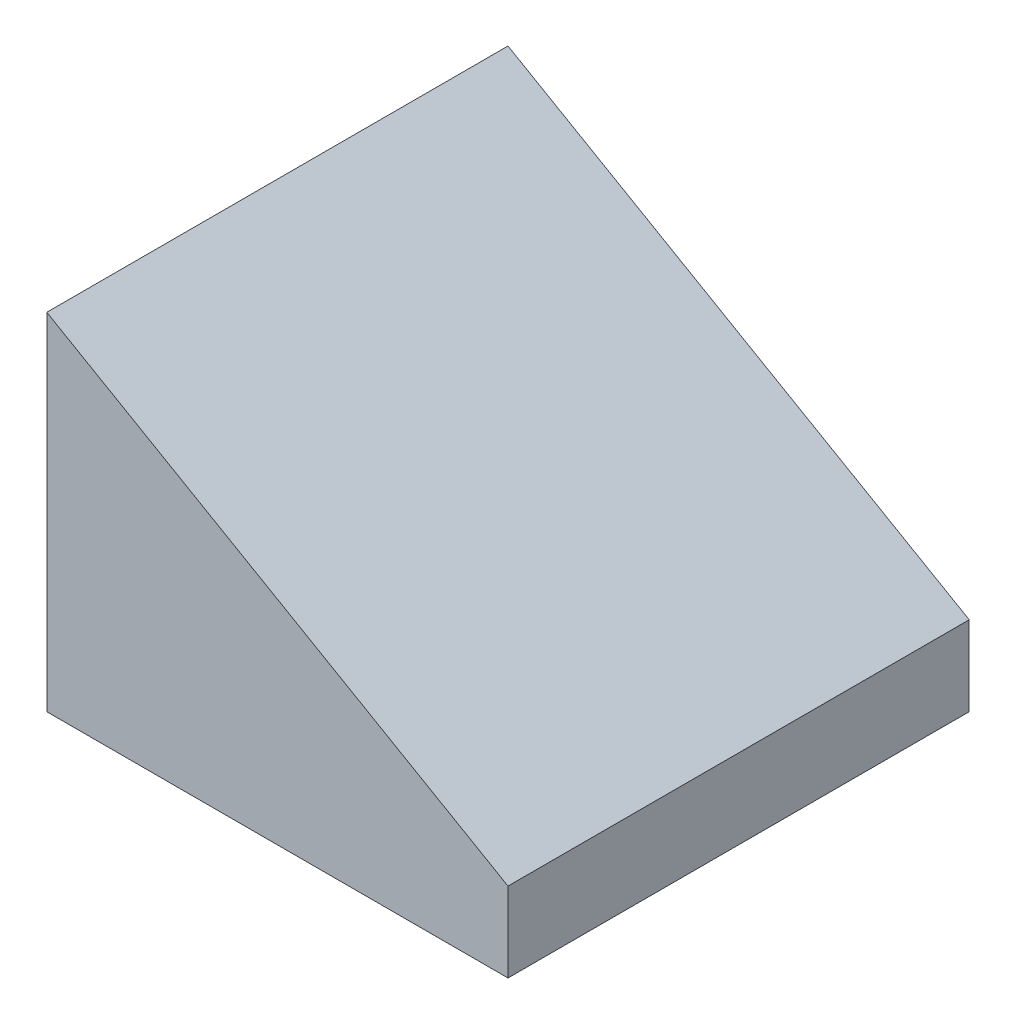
from build123d import *

# Parameters (mm, degrees)
LINEAR_AUSTRAGEN1_DEPTH         = 8
SKIZZE3_W                       = 8
SKIZZE3_H                       = 8
SKIZZE3_W_2                     = 7.2
SKIZZE3_H_2                     = 7.2
SCHNITT_LINEAR_AUSTRAGEN1_DEPTH = 0.4
SCHNITT_LINEAR_START            = -1.5
SCHNITT_LINEAR_AUSTRAGEN2_DEPTH = 5
SKIZZE5_R                       = 2.45
SCHNITT_LINEAR_AUSTRAGEN3_DEPTH = 2.2


with BuildPart() as part:
    # Skizze2 → Linear austragen1 (new body)
    with BuildSketch(Plane.XY):
        Polygon((0, 0), (0, 6.4), (8, 1.781197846), (8, 0), align=None)
    extrude(amount=LINEAR_AUSTRAGEN1_DEPTH)

    # Skizze3 → Schnitt-Linear austragen1 (cut)
    with BuildSketch(Plane.XZ):
        with Locations((4, 4)):
            Rectangle(SKIZZE3_W, SKIZZE3_H)
        with Locations((4, 4)):
            Rectangle(SKIZZE3_W_2, SKIZZE3_H_2, mode=Mode.SUBTRACT)
    extrude(amount=-SCHNITT_LINEAR_AUSTRAGEN1_DEPTH, mode=Mode.SUBTRACT)

    # Skizze4 → Schnitt-Linear austragen2 (cut)
    with BuildSketch(Plane(origin=(0, 0, 0), x_dir=(-1, 0, 0), z_dir=(0, 0, -1)).offset(SCHNITT_LINEAR_START)):
        Polygon((-6.5, 0), (-6.5, 1.6), (-1.5, 4.486751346), (-1.5, 0), align=None)
    extrude(amount=-SCHNITT_LINEAR_AUSTRAGEN2_DEPTH, mode=Mode.SUBTRACT)

    # Skizze5 → Schnitt-Linear austragen3 (cut)
    with BuildSketch(Plane.XZ):
        with Locations((4, 4)):
            Circle(SKIZZE5_R)
    extrude(amount=-SCHNITT_LINEAR_AUSTRAGEN3_DEPTH, mode=Mode.SUBTRACT)


solid = part.part
